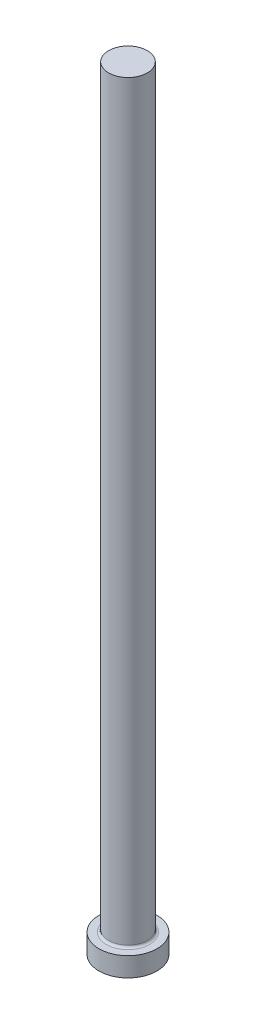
from build123d import *


with BuildPart() as part:
    # Sketch1 → Revolve1 (revolve)
    with BuildSketch(Plane.XY, mode=Mode.PRIVATE) as revolve1_sk:
        with BuildLine():
            Line((0, 0), (9.525, 0))
            Line((9.525, 0), (9.525, 6.35))
            Line((9.525, 6.35), (7.112, 6.35))
            ThreePointArc((7.112, 6.35), (6.573184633, 6.573184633), (6.35, 7.112))
            Line((6.35, 7.112), (6.35, 254))
            Line((6.35, 254), (0, 254))
            Line((0, 254), (0, 0))
        make_face()
    revolve(revolve1_sk.sketch.rotate(Axis((0, 254, 0), (0, -1, 0)), 180), axis=Axis((0, 254, 0), (0, -1, 0)))


solid = part.part
